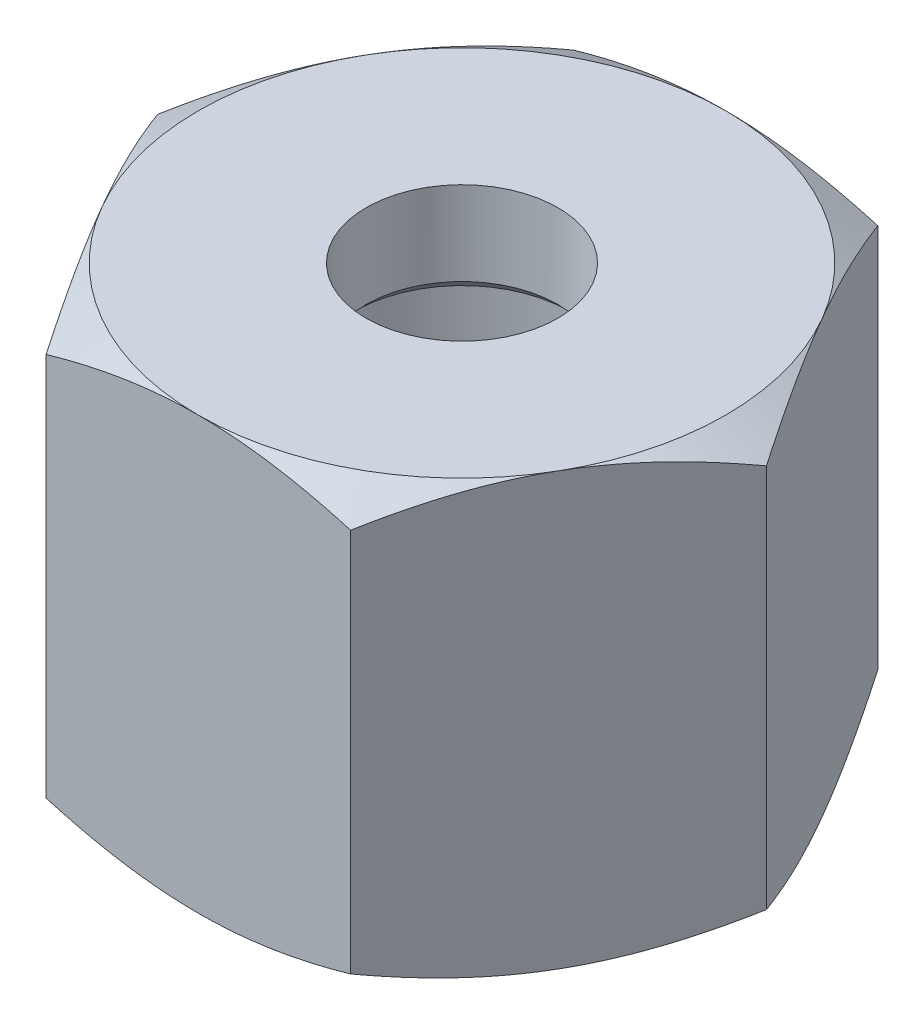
from build123d import *

# Parameters (mm, degrees)
P_IDAT_VYSUNUT_M1_DEPTH  = 18
SKICA2_OUTSIDE_W         = 38.492
SKICA2_OUTSIDE_H         = 35.088
SKICA2_OUTSIDE_R         = 11
ODEBRAT_VYSUNUT_M1_DEPTH = 1
ODEBRAT_VYSUNUT_M1_DRAFT = -60
SKICA3_OUTSIDE_W         = 38.492
SKICA3_OUTSIDE_H         = 35.088
SKICA3_OUTSIDE_R         = 11
ODEBRAT_VYSUNUT_M2_DEPTH = 1
ODEBRAT_VYSUNUT_M2_DRAFT = -60
SKICA4_R                 = 7.75
ODEBRAT_VYSUNUT_M3_DEPTH = 14
ZKOSEN_2_SIZE            = 0.35
ODEBRAT_VYSUNUT_M4_REACH = 26.624
SKICA5_R                 = 4
ZKOSEN_3_SIZE            = 0.5


with BuildPart() as part:
    # Skica1 → P_idat vysunut_m1 (new body)
    with BuildSketch(Plane(origin=(0, 0, 0), x_dir=(1, 0, 0), z_dir=(0, 1, 0))):
        Polygon((12.701705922, 0), (6.350852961, 11), (-6.350852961, 11), (-12.701705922, 0), (-6.350852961, -11), (6.350852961, -11), align=None)
    extrude(amount=P_IDAT_VYSUNUT_M1_DEPTH)


with BuildPart() as odebrat_vysunut_m1_tool:
    # Skica2 outside → Odebrat vysunut_m1 (with draft: the straight prism first)
    with BuildSketch(Plane(origin=(0, 18, 0), x_dir=(1, 0, 0), z_dir=(0, 1, 0))):
        Rectangle(SKICA2_OUTSIDE_W, SKICA2_OUTSIDE_H)
        Circle(SKICA2_OUTSIDE_R, mode=Mode.SUBTRACT)
    extrude(amount=-ODEBRAT_VYSUNUT_M1_DEPTH)
    # Odebrat vysunut_m1: the draft: its side faces are tilted about the plane it starts from
    odebrat_vysunut_m1_sides = [odebrat_vysunut_m1_tool.faces().sort_by_distance(p)[0] for p in [
        (0, 17.5, 17.544),
        (19.246, 17.5, 0),
        (0, 17.5, -17.544),
        (-19.246, 17.5, 0),
        (-11, 17.5, 0),
    ]]
    draft(odebrat_vysunut_m1_sides, Plane(origin=(0, 18, 0), x_dir=(1, 0, 0), z_dir=(0, 1, 0)), ODEBRAT_VYSUNUT_M1_DRAFT)


with BuildPart() as part_1:
    add(part.part)

    # Odebrat vysunut_m1: cut by odebrat_vysunut_m1_tool
    add(odebrat_vysunut_m1_tool.part, mode=Mode.SUBTRACT)


with BuildPart() as odebrat_vysunut_m2_tool:
    # Skica3 outside → Odebrat vysunut_m2 (with draft: the straight prism first)
    with BuildSketch(Plane.XZ):
        Rectangle(SKICA3_OUTSIDE_W, SKICA3_OUTSIDE_H)
        Circle(SKICA3_OUTSIDE_R, mode=Mode.SUBTRACT)
    extrude(amount=-ODEBRAT_VYSUNUT_M2_DEPTH)
    # Odebrat vysunut_m2: the draft: its side faces are tilted about the plane it starts from
    odebrat_vysunut_m2_sides = [odebrat_vysunut_m2_tool.faces().sort_by_distance(p)[0] for p in [
        (0, 0.5, -17.544),
        (19.246, 0.5, 0),
        (0, 0.5, 17.544),
        (-19.246, 0.5, 0),
        (-11, 0.5, 0),
    ]]
    draft(odebrat_vysunut_m2_sides, Plane.XZ, ODEBRAT_VYSUNUT_M2_DRAFT)


with BuildPart() as part_2:
    add(part_1.part)

    # Odebrat vysunut_m2: cut by odebrat_vysunut_m2_tool
    add(odebrat_vysunut_m2_tool.part, mode=Mode.SUBTRACT)

    # Skica4 → Odebrat vysunut_m3 (cut)
    with BuildSketch(Plane.XZ):
        with Locations(Location((0, 0, 0), (0, 0, 270))):
            Circle(SKICA4_R)
    extrude(amount=-ODEBRAT_VYSUNUT_M3_DEPTH, mode=Mode.SUBTRACT)

    # Zkosen_2
    zkosen_2_edges = [part_2.edges().sort_by_distance(p)[0] for p in [
        (0, 0, 7.75),
    ]]
    chamfer(zkosen_2_edges, length=ZKOSEN_2_SIZE)

    # Skica5 → Odebrat vysunut_m4 (cut, up to next)
    with BuildSketch(Plane(origin=(0, 18, 0), x_dir=(1, 0, 0), z_dir=(0, 1, 0)), mode=Mode.PRIVATE) as odebrat_vysunut_m4_sk1:
        with Locations(Location((0, 0, 0), (0, 0, 270))):
            Circle(SKICA5_R)
    odebrat_vysunut_m4_tool1 = extrude(odebrat_vysunut_m4_sk1.sketch, amount=-ODEBRAT_VYSUNUT_M4_REACH, mode=Mode.PRIVATE) & part_2.part
    add(odebrat_vysunut_m4_tool1.solids().sort_by_distance((0, 18, 0))[0], mode=Mode.SUBTRACT)

    # Zkosen_3
    zkosen_3_edges = [part_2.edges().sort_by_distance(p)[0] for p in [
        (0, 14, -4),
    ]]
    chamfer(zkosen_3_edges, length=ZKOSEN_3_SIZE)


solid = part_2.part
